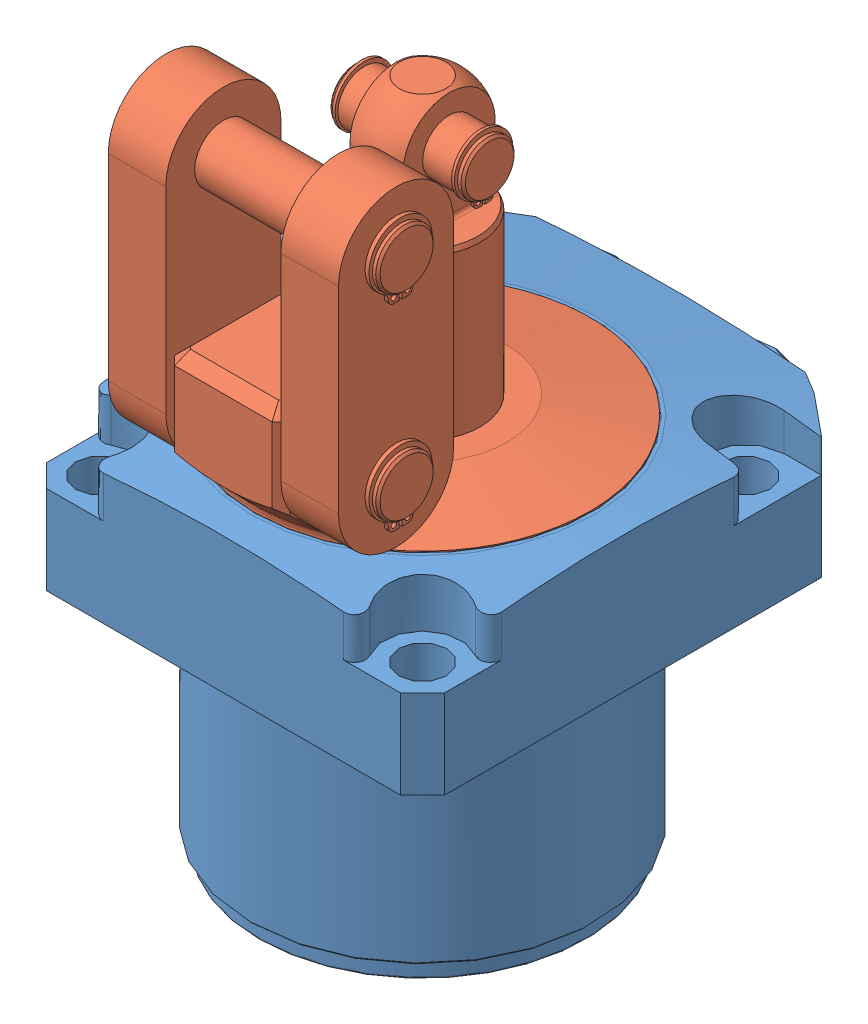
SolidWorks assembly ILCML1606300.sldasm, configuration Default (file format 3400). Lengths in mm.
Overall size (90 157.88 106.36).
2 component instances, 2 part files, 3 mates.
Components (placement in the parent):
- ILCML1606300_BODY-1: ILCML1606300_BODY.sldprt [Default] at origin size (90 84.19 106.36)
- ilcml1606300_LUG-1: ilcml1606300_LUG.SLDPRT [Default] at (0 19 0) size (75.75 86.5 82.88)
Mates (geometry in assembly coordinates):
- Coincident1: coincident anti-aligned: plane of ILCML1606300_BODY-1 through (37.875 19 0) normal (0 1 0); plane of ilcml1606300_LUG-1 through (-13 19 0) normal (0 -1 0)
- Concentric1: concentric anti-aligned: cylinder of ILCML1606300_BODY-1; cylinder of ilcml1606300_LUG-1
- LUG ANGLE: planar angle = 0 rad anti-aligned: unknown of ilcml1606300_LUG-1
